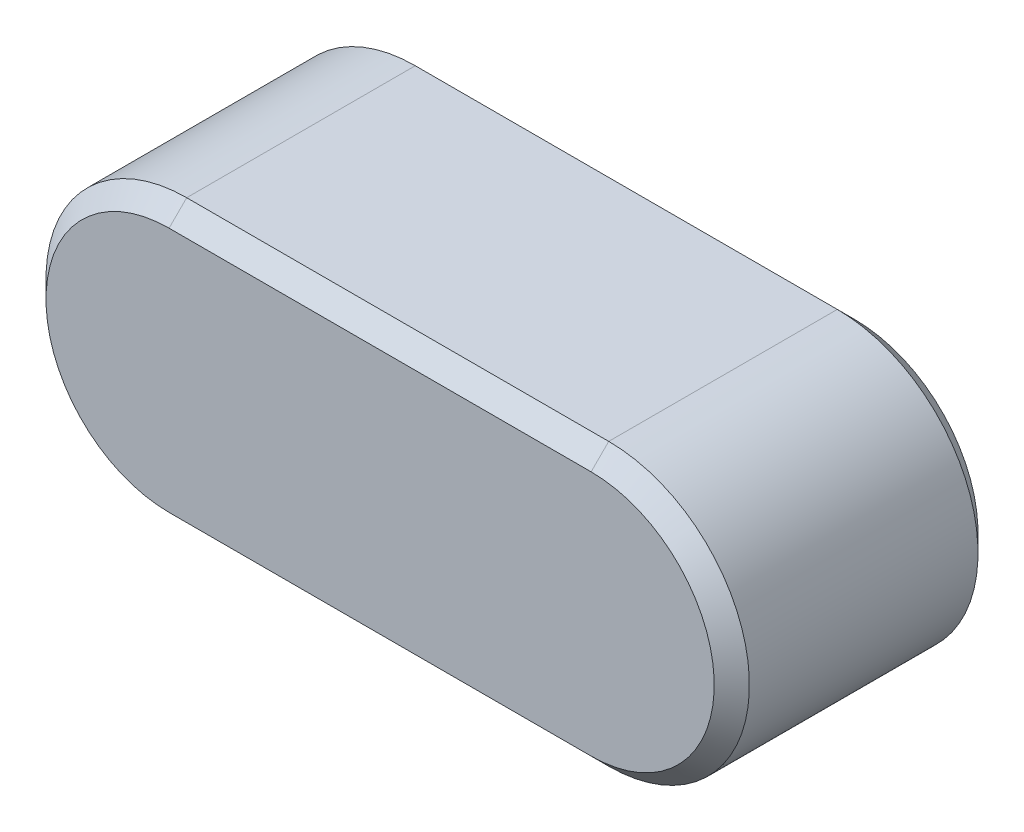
from build123d import *

# Parameters (mm, degrees)
BOSS_EXTRU_1_DEPTH = 7.5
CHANFREIN1_SIZE    = 0.5


with BuildPart() as part:
    # Esquisse1 → Boss.-Extru.1 (new body)
    with BuildSketch(Plane.XY):
        with BuildLine():
            Line((-23.840964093, 4), (-11.840964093, 4))
            ThreePointArc((-11.840964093, 4), (-7.840964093, 0), (-11.840964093, -4))
            Line((-11.840964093, -4), (-23.840964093, -4))
            ThreePointArc((-23.840964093, -4), (-27.840964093, 0), (-23.840964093, 4))
        make_face()
    extrude(amount=BOSS_EXTRU_1_DEPTH)

    # Chanfrein1
    chanfrein1_edges = [part.edges().sort_by_distance(p)[0] for p in [
        (-7.840964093, 0, 7.5),
        (-17.840964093, 4, 7.5),
        (-27.840964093, 0, 7.5),
        (-17.840964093, 4, 0),
        (-7.840964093, 0, 0),
        (-17.840964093, -4, 0),
        (-27.840964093, 0, 0),
        (-17.840964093, -4, 7.5),
    ]]
    chamfer(chanfrein1_edges, length=CHANFREIN1_SIZE)


solid = part.part
